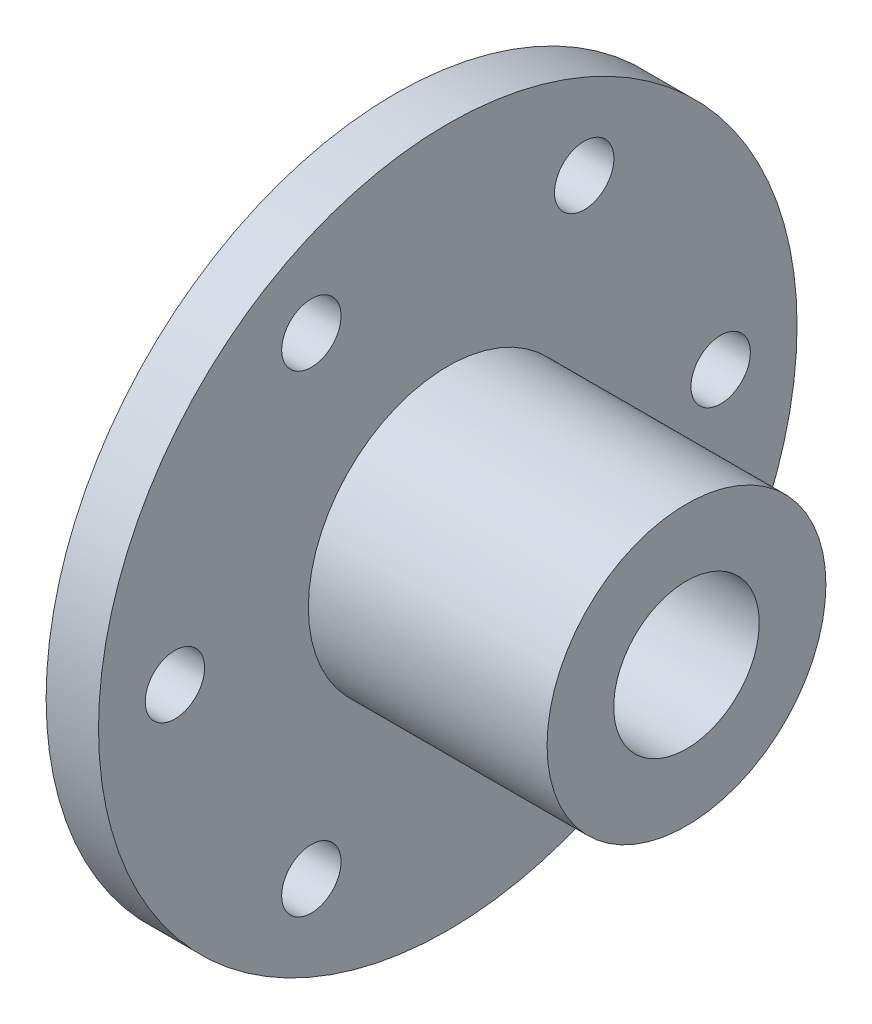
ISO-10303-21;
HEADER;
FILE_DESCRIPTION(('STEP AP214'),'2;1');
FILE_NAME('part.step','',(''),(''),'','','');
FILE_SCHEMA(('AUTOMOTIVE_DESIGN { 1 0 10303 214 1 1 1 1 }'));
ENDSEC;
DATA;
#1=APPLICATION_CONTEXT('core data for automotive mechanical design processes');
#2=APPLICATION_PROTOCOL_DEFINITION('international standard','automotive_design',2000,#1);
#3=PRODUCT_CONTEXT('',#1,'mechanical');
#4=PRODUCT('Part','Part','',(#3));
#5=PRODUCT_RELATED_PRODUCT_CATEGORY('part','',(#4));
#6=PRODUCT_DEFINITION_FORMATION('','',#4);
#7=PRODUCT_DEFINITION_CONTEXT('part definition',#1,'design');
#8=PRODUCT_DEFINITION('design','',#6,#7);
#9=PRODUCT_DEFINITION_SHAPE('','',#8);
#10=(LENGTH_UNIT() NAMED_UNIT(*) SI_UNIT(.MILLI.,.METRE.));
#11=(NAMED_UNIT(*) PLANE_ANGLE_UNIT() SI_UNIT($,.RADIAN.));
#12=(NAMED_UNIT(*) SI_UNIT($,.STERADIAN.) SOLID_ANGLE_UNIT());
#13=UNCERTAINTY_MEASURE_WITH_UNIT(LENGTH_MEASURE(1.E-05),#10,'distance_accuracy_value','');
#14=(GEOMETRIC_REPRESENTATION_CONTEXT(3) GLOBAL_UNCERTAINTY_ASSIGNED_CONTEXT((#13)) GLOBAL_UNIT_ASSIGNED_CONTEXT((#10,
#11,#12)) REPRESENTATION_CONTEXT('',''));
#15=CARTESIAN_POINT('',(0.,0.,0.));
#16=DIRECTION('',(0.,0.,1.));
#17=DIRECTION('',(1.,0.,0.));
#18=AXIS2_PLACEMENT_3D('',#15,#16,#17);
#19=CARTESIAN_POINT('',(-13.0350662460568,30.48,0.));
#20=DIRECTION('',(1.,0.,0.));
#21=DIRECTION('',(0.,0.,-1.));
#22=AXIS2_PLACEMENT_3D('',#19,#20,#21);
#23=PLANE('',#22);
#24=CARTESIAN_POINT('',(-13.0350662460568,0.,23.8125));
#25=DIRECTION('',(1.,0.,0.));
#26=DIRECTION('',(0.,0.,-1.));
#27=AXIS2_PLACEMENT_3D('',#24,#25,#26);
#28=CIRCLE('',#27,2.59080000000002);
#29=CARTESIAN_POINT('',(-13.0350662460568,0.,21.2217));
#30=VERTEX_POINT('',#29);
#31=EDGE_CURVE('E82',#30,#30,#28,.T.);
#32=ORIENTED_EDGE('',*,*,#31,.F.);
#33=EDGE_LOOP('',(#32));
#34=FACE_BOUND('',#33,.T.);
#35=CARTESIAN_POINT('',(-13.0350662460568,-20.622229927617,11.90625));
#36=DIRECTION('',(1.,0.,0.));
#37=DIRECTION('',(0.,0.,-1.));
#38=AXIS2_PLACEMENT_3D('',#35,#36,#37);
#39=CIRCLE('',#38,2.59080000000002);
#40=CARTESIAN_POINT('',(-13.0350662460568,-20.622229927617,9.31544999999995));
#41=VERTEX_POINT('',#40);
#42=EDGE_CURVE('E76',#41,#41,#39,.T.);
#43=ORIENTED_EDGE('',*,*,#42,.F.);
#44=EDGE_LOOP('',(#43));
#45=FACE_BOUND('',#44,.T.);
#46=CARTESIAN_POINT('',(-13.0350662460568,-20.6222299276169,-11.90625));
#47=DIRECTION('',(1.,0.,0.));
#48=DIRECTION('',(0.,0.,-1.));
#49=AXIS2_PLACEMENT_3D('',#46,#47,#48);
#50=CIRCLE('',#49,2.59080000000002);
#51=CARTESIAN_POINT('',(-13.0350662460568,-20.6222299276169,-14.49705));
#52=VERTEX_POINT('',#51);
#53=EDGE_CURVE('E70',#52,#52,#50,.T.);
#54=ORIENTED_EDGE('',*,*,#53,.F.);
#55=EDGE_LOOP('',(#54));
#56=FACE_BOUND('',#55,.T.);
#57=CARTESIAN_POINT('',(-13.0350662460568,0.,-23.8125));
#58=DIRECTION('',(1.,0.,0.));
#59=DIRECTION('',(0.,0.,-1.));
#60=AXIS2_PLACEMENT_3D('',#57,#58,#59);
#61=CIRCLE('',#60,2.59080000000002);
#62=CARTESIAN_POINT('',(-13.0350662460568,0.,-26.4033));
#63=VERTEX_POINT('',#62);
#64=EDGE_CURVE('E64',#63,#63,#61,.T.);
#65=ORIENTED_EDGE('',*,*,#64,.F.);
#66=EDGE_LOOP('',(#65));
#67=FACE_BOUND('',#66,.T.);
#68=CARTESIAN_POINT('',(-13.0350662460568,20.6222299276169,-11.90625));
#69=DIRECTION('',(1.,0.,0.));
#70=DIRECTION('',(0.,0.,-1.));
#71=AXIS2_PLACEMENT_3D('',#68,#69,#70);
#72=CIRCLE('',#71,2.59080000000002);
#73=CARTESIAN_POINT('',(-13.0350662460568,20.6222299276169,-14.49705));
#74=VERTEX_POINT('',#73);
#75=EDGE_CURVE('E58',#74,#74,#72,.T.);
#76=ORIENTED_EDGE('',*,*,#75,.F.);
#77=EDGE_LOOP('',(#76));
#78=FACE_BOUND('',#77,.T.);
#79=CARTESIAN_POINT('',(-13.0350662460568,20.6222299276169,11.90625));
#80=DIRECTION('',(1.,0.,0.));
#81=DIRECTION('',(0.,0.,-1.));
#82=AXIS2_PLACEMENT_3D('',#79,#80,#81);
#83=CIRCLE('',#82,2.59080000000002);
#84=CARTESIAN_POINT('',(-13.0350662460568,20.6222299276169,9.31545000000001));
#85=VERTEX_POINT('',#84);
#86=EDGE_CURVE('E51',#85,#85,#83,.T.);
#87=ORIENTED_EDGE('',*,*,#86,.F.);
#88=EDGE_LOOP('',(#87));
#89=FACE_BOUND('',#88,.T.);
#90=CARTESIAN_POINT('',(-13.0350662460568,0.,0.));
#91=DIRECTION('',(-1.,0.,0.));
#92=DIRECTION('',(0.,0.,1.));
#93=AXIS2_PLACEMENT_3D('',#90,#91,#92);
#94=CIRCLE('',#93,30.48);
#95=CARTESIAN_POINT('',(-13.0350662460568,0.,30.48));
#96=VERTEX_POINT('',#95);
#97=EDGE_CURVE('E10',#96,#96,#94,.T.);
#98=ORIENTED_EDGE('',*,*,#97,.F.);
#99=EDGE_LOOP('',(#98));
#100=FACE_BOUND('',#99,.T.);
#101=CARTESIAN_POINT('',(-13.0350662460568,0.,0.));
#102=DIRECTION('',(1.,0.,0.));
#103=DIRECTION('',(0.,0.,-1.));
#104=AXIS2_PLACEMENT_3D('',#101,#102,#103);
#105=CIRCLE('',#104,12.1666);
#106=CARTESIAN_POINT('',(-13.0350662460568,0.,-12.1666));
#107=VERTEX_POINT('',#106);
#108=EDGE_CURVE('E47',#107,#107,#105,.T.);
#109=ORIENTED_EDGE('',*,*,#108,.F.);
#110=EDGE_LOOP('',(#109));
#111=FACE_BOUND('',#110,.T.);
#112=ADVANCED_FACE('F32',(#34,#45,#56,#67,#78,#89,#100,#111),#23,.T.);
#113=CARTESIAN_POINT('',(-13.0350662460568,0.,0.));
#114=DIRECTION('',(-1.,0.,0.));
#115=DIRECTION('',(0.,0.,1.));
#116=AXIS2_PLACEMENT_3D('',#113,#114,#115);
#117=CYLINDRICAL_SURFACE('',#116,30.48);
#118=ORIENTED_EDGE('',*,*,#97,.T.);
#119=EDGE_LOOP('',(#118));
#120=FACE_BOUND('',#119,.T.);
#121=CARTESIAN_POINT('',(-17.6070662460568,0.,0.));
#122=DIRECTION('',(-1.,0.,0.));
#123=DIRECTION('',(0.,0.,1.));
#124=AXIS2_PLACEMENT_3D('',#121,#122,#123);
#125=CIRCLE('',#124,30.48);
#126=CARTESIAN_POINT('',(-17.6070662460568,0.,30.48));
#127=VERTEX_POINT('',#126);
#128=EDGE_CURVE('E39',#127,#127,#125,.T.);
#129=ORIENTED_EDGE('',*,*,#128,.F.);
#130=EDGE_LOOP('',(#129));
#131=FACE_BOUND('',#130,.T.);
#132=ADVANCED_FACE('F34',(#120,#131),#117,.T.);
#133=CARTESIAN_POINT('',(-17.6070662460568,0.,0.));
#134=DIRECTION('',(-1.,0.,0.));
#135=DIRECTION('',(0.,0.,1.));
#136=AXIS2_PLACEMENT_3D('',#133,#134,#135);
#137=PLANE('',#136);
#138=CARTESIAN_POINT('',(-17.6070662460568,0.,0.));
#139=DIRECTION('',(1.,0.,0.));
#140=DIRECTION('',(0.,0.,-1.));
#141=AXIS2_PLACEMENT_3D('',#138,#139,#140);
#142=CIRCLE('',#141,6.35);
#143=CARTESIAN_POINT('',(-17.6070662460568,0.,-6.35));
#144=VERTEX_POINT('',#143);
#145=EDGE_CURVE('E88',#144,#144,#142,.T.);
#146=ORIENTED_EDGE('',*,*,#145,.T.);
#147=EDGE_LOOP('',(#146));
#148=FACE_BOUND('',#147,.T.);
#149=CARTESIAN_POINT('',(-17.6070662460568,0.,23.8125));
#150=DIRECTION('',(-1.,0.,0.));
#151=DIRECTION('',(0.,0.,1.));
#152=AXIS2_PLACEMENT_3D('',#149,#150,#151);
#153=CIRCLE('',#152,2.59080000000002);
#154=CARTESIAN_POINT('',(-17.6070662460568,0.,26.4033));
#155=VERTEX_POINT('',#154);
#156=EDGE_CURVE('E85',#155,#155,#153,.T.);
#157=ORIENTED_EDGE('',*,*,#156,.F.);
#158=EDGE_LOOP('',(#157));
#159=FACE_BOUND('',#158,.T.);
#160=CARTESIAN_POINT('',(-17.6070662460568,-20.622229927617,11.90625));
#161=DIRECTION('',(-1.,0.,0.));
#162=DIRECTION('',(0.,0.,1.));
#163=AXIS2_PLACEMENT_3D('',#160,#161,#162);
#164=CIRCLE('',#163,2.59080000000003);
#165=CARTESIAN_POINT('',(-17.6070662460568,-20.622229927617,14.49705));
#166=VERTEX_POINT('',#165);
#167=EDGE_CURVE('E79',#166,#166,#164,.T.);
#168=ORIENTED_EDGE('',*,*,#167,.F.);
#169=EDGE_LOOP('',(#168));
#170=FACE_BOUND('',#169,.T.);
#171=CARTESIAN_POINT('',(-17.6070662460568,-20.6222299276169,-11.90625));
#172=DIRECTION('',(-1.,0.,0.));
#173=DIRECTION('',(0.,0.,1.));
#174=AXIS2_PLACEMENT_3D('',#171,#172,#173);
#175=CIRCLE('',#174,2.59080000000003);
#176=CARTESIAN_POINT('',(-17.6070662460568,-20.6222299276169,-9.31544999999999));
#177=VERTEX_POINT('',#176);
#178=EDGE_CURVE('E73',#177,#177,#175,.T.);
#179=ORIENTED_EDGE('',*,*,#178,.F.);
#180=EDGE_LOOP('',(#179));
#181=FACE_BOUND('',#180,.T.);
#182=CARTESIAN_POINT('',(-17.6070662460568,0.,-23.8125));
#183=DIRECTION('',(-1.,0.,0.));
#184=DIRECTION('',(0.,0.,1.));
#185=AXIS2_PLACEMENT_3D('',#182,#183,#184);
#186=CIRCLE('',#185,2.59080000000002);
#187=CARTESIAN_POINT('',(-17.6070662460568,0.,-21.2217));
#188=VERTEX_POINT('',#187);
#189=EDGE_CURVE('E67',#188,#188,#186,.T.);
#190=ORIENTED_EDGE('',*,*,#189,.F.);
#191=EDGE_LOOP('',(#190));
#192=FACE_BOUND('',#191,.T.);
#193=CARTESIAN_POINT('',(-17.6070662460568,20.6222299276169,-11.90625));
#194=DIRECTION('',(-1.,0.,0.));
#195=DIRECTION('',(0.,0.,1.));
#196=AXIS2_PLACEMENT_3D('',#193,#194,#195);
#197=CIRCLE('',#196,2.59080000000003);
#198=CARTESIAN_POINT('',(-17.6070662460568,20.6222299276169,-9.31544999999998));
#199=VERTEX_POINT('',#198);
#200=EDGE_CURVE('E61',#199,#199,#197,.T.);
#201=ORIENTED_EDGE('',*,*,#200,.F.);
#202=EDGE_LOOP('',(#201));
#203=FACE_BOUND('',#202,.T.);
#204=CARTESIAN_POINT('',(-17.6070662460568,20.6222299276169,11.90625));
#205=DIRECTION('',(-1.,0.,0.));
#206=DIRECTION('',(0.,0.,1.));
#207=AXIS2_PLACEMENT_3D('',#204,#205,#206);
#208=CIRCLE('',#207,2.59080000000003);
#209=CARTESIAN_POINT('',(-17.6070662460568,20.6222299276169,14.4970500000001));
#210=VERTEX_POINT('',#209);
#211=EDGE_CURVE('E55',#210,#210,#208,.T.);
#212=ORIENTED_EDGE('',*,*,#211,.F.);
#213=EDGE_LOOP('',(#212));
#214=FACE_BOUND('',#213,.T.);
#215=ORIENTED_EDGE('',*,*,#128,.T.);
#216=EDGE_LOOP('',(#215));
#217=FACE_BOUND('',#216,.T.);
#218=ADVANCED_FACE('F95',(#148,#159,#170,#181,#192,#203,#214,#217),#137,.T.);
#219=CARTESIAN_POINT('',(7.79293375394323,0.,0.));
#220=DIRECTION('',(-1.,0.,0.));
#221=DIRECTION('',(0.,0.,1.));
#222=AXIS2_PLACEMENT_3D('',#219,#220,#221);
#223=CYLINDRICAL_SURFACE('',#222,12.1666);
#224=CARTESIAN_POINT('',(7.79293375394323,0.,0.));
#225=DIRECTION('',(1.,0.,0.));
#226=DIRECTION('',(0.,0.,-1.));
#227=AXIS2_PLACEMENT_3D('',#224,#225,#226);
#228=CIRCLE('',#227,12.1666);
#229=CARTESIAN_POINT('',(7.79293375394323,0.,-12.1666));
#230=VERTEX_POINT('',#229);
#231=EDGE_CURVE('E43',#230,#230,#228,.T.);
#232=ORIENTED_EDGE('',*,*,#231,.F.);
#233=EDGE_LOOP('',(#232));
#234=FACE_BOUND('',#233,.T.);
#235=ORIENTED_EDGE('',*,*,#108,.T.);
#236=EDGE_LOOP('',(#235));
#237=FACE_BOUND('',#236,.T.);
#238=ADVANCED_FACE('F109',(#234,#237),#223,.T.);
#239=CARTESIAN_POINT('',(7.79293375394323,0.,0.));
#240=DIRECTION('',(1.,0.,0.));
#241=DIRECTION('',(0.,0.,-1.));
#242=AXIS2_PLACEMENT_3D('',#239,#240,#241);
#243=PLANE('',#242);
#244=CARTESIAN_POINT('',(7.79293375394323,0.,0.));
#245=DIRECTION('',(1.,0.,0.));
#246=DIRECTION('',(0.,0.,-1.));
#247=AXIS2_PLACEMENT_3D('',#244,#245,#246);
#248=CIRCLE('',#247,6.35);
#249=CARTESIAN_POINT('',(7.79293375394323,0.,-6.35));
#250=VERTEX_POINT('',#249);
#251=EDGE_CURVE('E89',#250,#250,#248,.T.);
#252=ORIENTED_EDGE('',*,*,#251,.F.);
#253=EDGE_LOOP('',(#252));
#254=FACE_BOUND('',#253,.T.);
#255=ORIENTED_EDGE('',*,*,#231,.T.);
#256=EDGE_LOOP('',(#255));
#257=FACE_BOUND('',#256,.T.);
#258=ADVANCED_FACE('F105',(#254,#257),#243,.T.);
#259=CARTESIAN_POINT('',(-17.6070662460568,20.6222299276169,11.90625));
#260=DIRECTION('',(-1.,0.,0.));
#261=DIRECTION('',(0.,0.,1.));
#262=AXIS2_PLACEMENT_3D('',#259,#260,#261);
#263=CYLINDRICAL_SURFACE('',#262,2.59080000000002);
#264=ORIENTED_EDGE('',*,*,#86,.T.);
#265=EDGE_LOOP('',(#264));
#266=FACE_BOUND('',#265,.T.);
#267=ORIENTED_EDGE('',*,*,#211,.T.);
#268=EDGE_LOOP('',(#267));
#269=FACE_BOUND('',#268,.T.);
#270=ADVANCED_FACE('F108',(#266,#269),#263,.F.);
#271=CARTESIAN_POINT('',(-17.6070662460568,20.6222299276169,-11.90625));
#272=DIRECTION('',(-1.,0.,0.));
#273=DIRECTION('',(0.,0.,1.));
#274=AXIS2_PLACEMENT_3D('',#271,#272,#273);
#275=CYLINDRICAL_SURFACE('',#274,2.59080000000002);
#276=ORIENTED_EDGE('',*,*,#75,.T.);
#277=EDGE_LOOP('',(#276));
#278=FACE_BOUND('',#277,.T.);
#279=ORIENTED_EDGE('',*,*,#200,.T.);
#280=EDGE_LOOP('',(#279));
#281=FACE_BOUND('',#280,.T.);
#282=ADVANCED_FACE('F130',(#278,#281),#275,.F.);
#283=CARTESIAN_POINT('',(-17.6070662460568,0.,-23.8125));
#284=DIRECTION('',(-1.,0.,0.));
#285=DIRECTION('',(0.,0.,1.));
#286=AXIS2_PLACEMENT_3D('',#283,#284,#285);
#287=CYLINDRICAL_SURFACE('',#286,2.59080000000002);
#288=ORIENTED_EDGE('',*,*,#64,.T.);
#289=EDGE_LOOP('',(#288));
#290=FACE_BOUND('',#289,.T.);
#291=ORIENTED_EDGE('',*,*,#189,.T.);
#292=EDGE_LOOP('',(#291));
#293=FACE_BOUND('',#292,.T.);
#294=ADVANCED_FACE('F134',(#290,#293),#287,.F.);
#295=CARTESIAN_POINT('',(-17.6070662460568,-20.6222299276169,-11.90625));
#296=DIRECTION('',(-1.,0.,0.));
#297=DIRECTION('',(0.,0.,1.));
#298=AXIS2_PLACEMENT_3D('',#295,#296,#297);
#299=CYLINDRICAL_SURFACE('',#298,2.59080000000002);
#300=ORIENTED_EDGE('',*,*,#53,.T.);
#301=EDGE_LOOP('',(#300));
#302=FACE_BOUND('',#301,.T.);
#303=ORIENTED_EDGE('',*,*,#178,.T.);
#304=EDGE_LOOP('',(#303));
#305=FACE_BOUND('',#304,.T.);
#306=ADVANCED_FACE('F138',(#302,#305),#299,.F.);
#307=CARTESIAN_POINT('',(-17.6070662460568,-20.622229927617,11.90625));
#308=DIRECTION('',(-1.,0.,0.));
#309=DIRECTION('',(0.,0.,1.));
#310=AXIS2_PLACEMENT_3D('',#307,#308,#309);
#311=CYLINDRICAL_SURFACE('',#310,2.59080000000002);
#312=ORIENTED_EDGE('',*,*,#42,.T.);
#313=EDGE_LOOP('',(#312));
#314=FACE_BOUND('',#313,.T.);
#315=ORIENTED_EDGE('',*,*,#167,.T.);
#316=EDGE_LOOP('',(#315));
#317=FACE_BOUND('',#316,.T.);
#318=ADVANCED_FACE('F142',(#314,#317),#311,.F.);
#319=CARTESIAN_POINT('',(-17.6070662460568,0.,23.8125));
#320=DIRECTION('',(-1.,0.,0.));
#321=DIRECTION('',(0.,0.,1.));
#322=AXIS2_PLACEMENT_3D('',#319,#320,#321);
#323=CYLINDRICAL_SURFACE('',#322,2.59080000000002);
#324=ORIENTED_EDGE('',*,*,#31,.T.);
#325=EDGE_LOOP('',(#324));
#326=FACE_BOUND('',#325,.T.);
#327=ORIENTED_EDGE('',*,*,#156,.T.);
#328=EDGE_LOOP('',(#327));
#329=FACE_BOUND('',#328,.T.);
#330=ADVANCED_FACE('F101',(#326,#329),#323,.F.);
#331=CARTESIAN_POINT('',(-17.6070662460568,0.,0.));
#332=DIRECTION('',(1.,0.,0.));
#333=DIRECTION('',(0.,0.,-1.));
#334=AXIS2_PLACEMENT_3D('',#331,#332,#333);
#335=CYLINDRICAL_SURFACE('',#334,6.35);
#336=ORIENTED_EDGE('',*,*,#145,.F.);
#337=EDGE_LOOP('',(#336));
#338=FACE_BOUND('',#337,.T.);
#339=ORIENTED_EDGE('',*,*,#251,.T.);
#340=EDGE_LOOP('',(#339));
#341=FACE_BOUND('',#340,.T.);
#342=ADVANCED_FACE('F98',(#338,#341),#335,.F.);
#343=CLOSED_SHELL('',(#112,#132,#218,#238,#258,#270,#282,#294,#306,#318,#330,#342));
#344=MANIFOLD_SOLID_BREP('B2',#343);
#345=ADVANCED_BREP_SHAPE_REPRESENTATION('',(#18,#344),#14);
#346=SHAPE_DEFINITION_REPRESENTATION(#9,#345);
ENDSEC;
END-ISO-10303-21;
